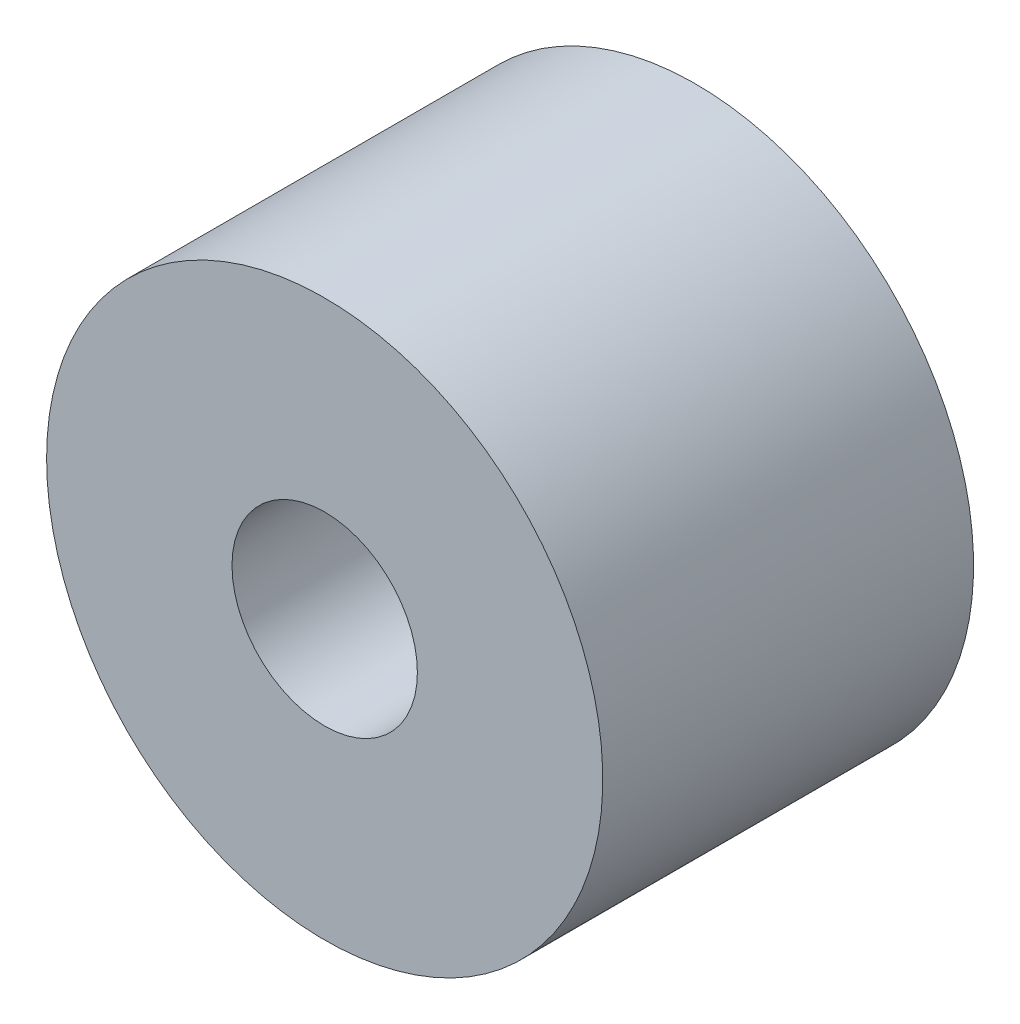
from build123d import *

# Parameters (mm, degrees)
SKETCH1_W = 6
SKETCH1_H = 3


with BuildPart() as part:
    # Sketch1 → Revolve1 (revolve)
    with BuildSketch(Plane(origin=(0, 0, 0), x_dir=(0, 0, -1), z_dir=(1, 0, 0)), mode=Mode.PRIVATE) as revolve1_sk:
        with Locations((0, -3)):
            Rectangle(SKETCH1_W, SKETCH1_H)
    revolve(revolve1_sk.sketch.rotate(Axis((0, 0, 0), (0, 0, 1)), 270), axis=Axis((0, 0, 0), (0, 0, 1)))


solid = part.part
